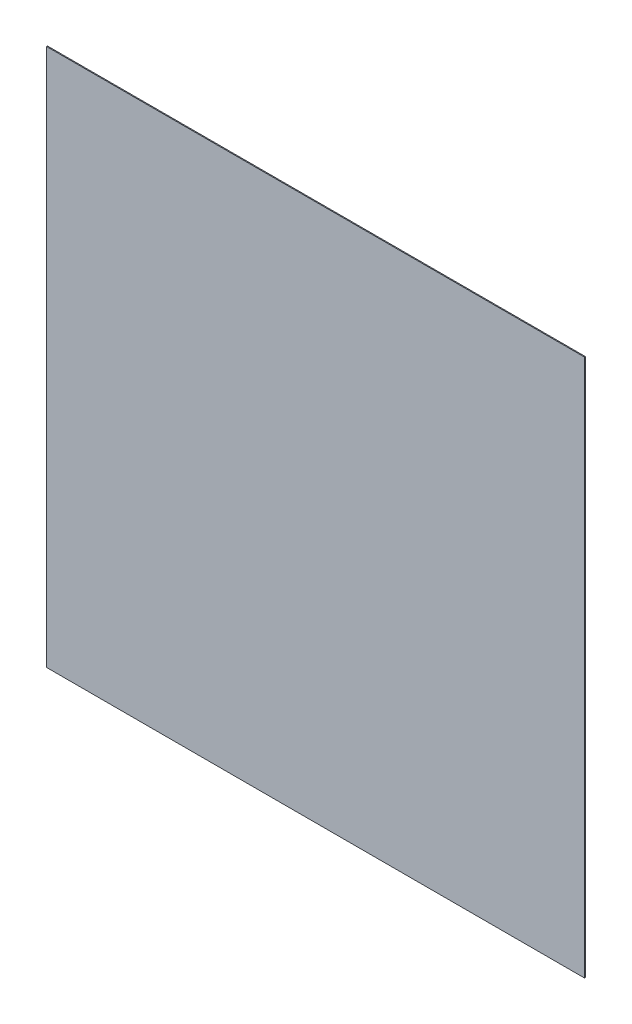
from build123d import *

# Parameters (mm, degrees)
SKETCH1_W      = 3657.6
SKETCH1_H      = 3657.6
EXTRUDE1_DEPTH = 6.35


with BuildPart() as part:
    # Sketch1 → Extrude1 (new body)
    with BuildSketch(Plane.XY):
        Rectangle(SKETCH1_W, SKETCH1_H)
    extrude(amount=-EXTRUDE1_DEPTH)


solid = part.part
